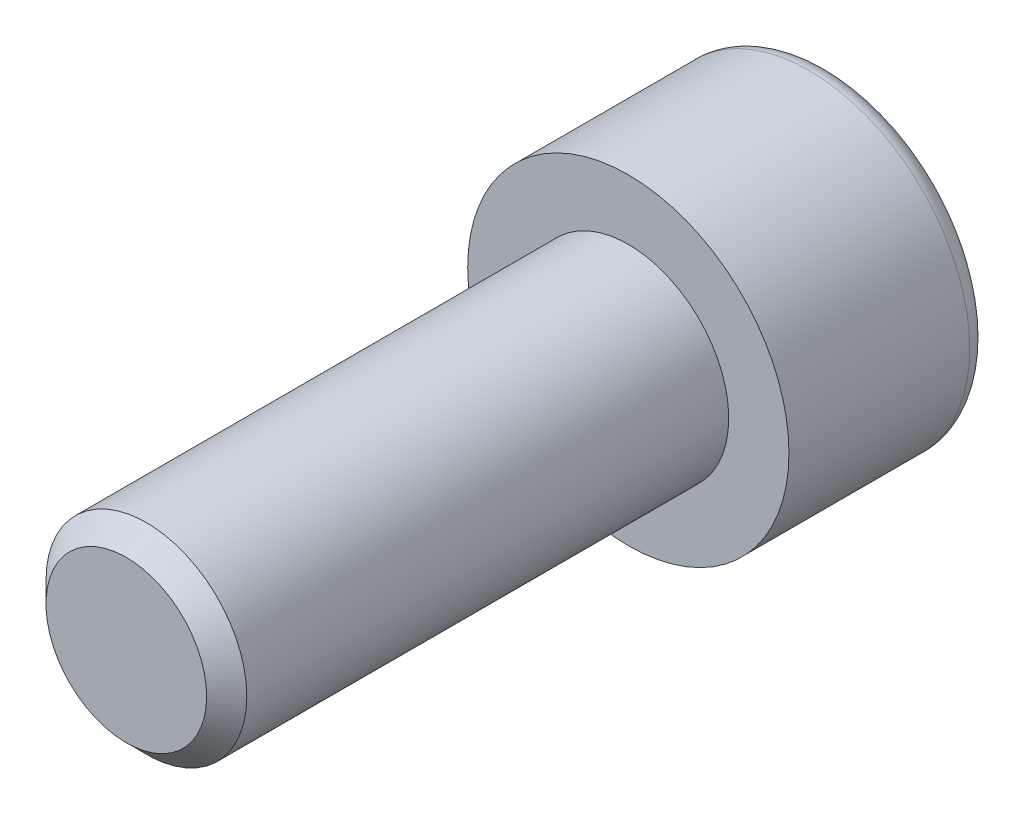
ISO-10303-21;
HEADER;
FILE_DESCRIPTION(('STEP AP214'),'2;1');
FILE_NAME('part.step','',(''),(''),'','','');
FILE_SCHEMA(('AUTOMOTIVE_DESIGN { 1 0 10303 214 1 1 1 1 }'));
ENDSEC;
DATA;
#1=APPLICATION_CONTEXT('core data for automotive mechanical design processes');
#2=APPLICATION_PROTOCOL_DEFINITION('international standard','automotive_design',2000,#1);
#3=PRODUCT_CONTEXT('',#1,'mechanical');
#4=PRODUCT('Part','Part','',(#3));
#5=PRODUCT_RELATED_PRODUCT_CATEGORY('part','',(#4));
#6=PRODUCT_DEFINITION_FORMATION('','',#4);
#7=PRODUCT_DEFINITION_CONTEXT('part definition',#1,'design');
#8=PRODUCT_DEFINITION('design','',#6,#7);
#9=PRODUCT_DEFINITION_SHAPE('','',#8);
#10=(LENGTH_UNIT() NAMED_UNIT(*) SI_UNIT(.MILLI.,.METRE.));
#11=(NAMED_UNIT(*) PLANE_ANGLE_UNIT() SI_UNIT($,.RADIAN.));
#12=(NAMED_UNIT(*) SI_UNIT($,.STERADIAN.) SOLID_ANGLE_UNIT());
#13=UNCERTAINTY_MEASURE_WITH_UNIT(LENGTH_MEASURE(1.E-05),#10,'distance_accuracy_value','');
#14=(GEOMETRIC_REPRESENTATION_CONTEXT(3) GLOBAL_UNCERTAINTY_ASSIGNED_CONTEXT((#13)) GLOBAL_UNIT_ASSIGNED_CONTEXT((#10,
#11,#12)) REPRESENTATION_CONTEXT('',''));
#15=CARTESIAN_POINT('',(0.,0.,0.));
#16=DIRECTION('',(0.,0.,1.));
#17=DIRECTION('',(1.,0.,0.));
#18=AXIS2_PLACEMENT_3D('',#15,#16,#17);
#19=CARTESIAN_POINT('',(0.,0.,-10.));
#20=DIRECTION('',(0.,0.,1.));
#21=DIRECTION('',(1.,0.,0.));
#22=AXIS2_PLACEMENT_3D('',#19,#20,#21);
#23=PLANE('',#22);
#24=CARTESIAN_POINT('',(0.,0.,-10.));
#25=DIRECTION('',(0.,0.,-1.));
#26=DIRECTION('',(-1.,0.,0.));
#27=AXIS2_PLACEMENT_3D('',#24,#25,#26);
#28=CIRCLE('',#27,7.);
#29=CARTESIAN_POINT('',(-7.,0.,-10.));
#30=VERTEX_POINT('',#29);
#31=EDGE_CURVE('E148',#30,#30,#28,.T.);
#32=ORIENTED_EDGE('',*,*,#31,.T.);
#33=EDGE_LOOP('',(#32));
#34=FACE_BOUND('',#33,.T.);
#35=DIRECTION('',(-0.86602540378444,0.499999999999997,0.));
#36=VECTOR('',#35,1.);
#37=CARTESIAN_POINT('',(0.,4.61880215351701,-10.));
#38=LINE('',#37,#36);
#39=CARTESIAN_POINT('',(4.,2.30940107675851,-10.));
#40=VERTEX_POINT('',#39);
#41=CARTESIAN_POINT('',(0.,4.61880215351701,-10.));
#42=VERTEX_POINT('',#41);
#43=EDGE_CURVE('E51',#40,#42,#38,.T.);
#44=ORIENTED_EDGE('',*,*,#43,.T.);
#45=DIRECTION('',(-0.866025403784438,-0.500000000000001,0.));
#46=VECTOR('',#45,1.);
#47=CARTESIAN_POINT('',(0.,4.61880215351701,-10.));
#48=LINE('',#47,#46);
#49=CARTESIAN_POINT('',(-4.,2.30940107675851,-10.));
#50=VERTEX_POINT('',#49);
#51=EDGE_CURVE('E91',#42,#50,#48,.T.);
#52=ORIENTED_EDGE('',*,*,#51,.T.);
#53=DIRECTION('',(0.,-1.,0.));
#54=VECTOR('',#53,1.);
#55=CARTESIAN_POINT('',(-4.,-2.30940107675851,-10.));
#56=LINE('',#55,#54);
#57=CARTESIAN_POINT('',(-4.,-2.30940107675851,-10.));
#58=VERTEX_POINT('',#57);
#59=EDGE_CURVE('E99',#50,#58,#56,.T.);
#60=ORIENTED_EDGE('',*,*,#59,.T.);
#61=DIRECTION('',(0.866025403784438,-0.500000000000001,0.));
#62=VECTOR('',#61,1.);
#63=CARTESIAN_POINT('',(0.,-4.61880215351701,-10.));
#64=LINE('',#63,#62);
#65=CARTESIAN_POINT('',(0.,-4.61880215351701,-10.));
#66=VERTEX_POINT('',#65);
#67=EDGE_CURVE('E117',#58,#66,#64,.T.);
#68=ORIENTED_EDGE('',*,*,#67,.T.);
#69=DIRECTION('',(0.86602540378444,0.499999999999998,0.));
#70=VECTOR('',#69,1.);
#71=CARTESIAN_POINT('',(0.,-4.61880215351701,-10.));
#72=LINE('',#71,#70);
#73=CARTESIAN_POINT('',(4.,-2.30940107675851,-10.));
#74=VERTEX_POINT('',#73);
#75=EDGE_CURVE('E120',#66,#74,#72,.T.);
#76=ORIENTED_EDGE('',*,*,#75,.T.);
#77=DIRECTION('',(0.,1.,0.));
#78=VECTOR('',#77,1.);
#79=CARTESIAN_POINT('',(4.,-2.30940107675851,-10.));
#80=LINE('',#79,#78);
#81=EDGE_CURVE('E110',#74,#40,#80,.T.);
#82=ORIENTED_EDGE('',*,*,#81,.T.);
#83=EDGE_LOOP('',(#44,#52,#60,#68,#76,#82));
#84=FACE_BOUND('',#83,.T.);
#85=ADVANCED_FACE('F37',(#34,#84),#23,.F.);
#86=CARTESIAN_POINT('',(0.,0.,-9.));
#87=DIRECTION('',(0.,0.,-1.));
#88=DIRECTION('',(-1.,0.,0.));
#89=AXIS2_PLACEMENT_3D('',#86,#87,#88);
#90=TOROIDAL_SURFACE('',#89,7.,0.999999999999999);
#91=ORIENTED_EDGE('',*,*,#31,.F.);
#92=EDGE_LOOP('',(#91));
#93=FACE_BOUND('',#92,.T.);
#94=CARTESIAN_POINT('',(0.,0.,-9.));
#95=DIRECTION('',(0.,0.,-1.));
#96=DIRECTION('',(-1.,0.,0.));
#97=AXIS2_PLACEMENT_3D('',#94,#95,#96);
#98=CIRCLE('',#97,8.);
#99=CARTESIAN_POINT('',(-8.,0.,-9.));
#100=VERTEX_POINT('',#99);
#101=EDGE_CURVE('E144',#100,#100,#98,.T.);
#102=ORIENTED_EDGE('',*,*,#101,.T.);
#103=EDGE_LOOP('',(#102));
#104=FACE_BOUND('',#103,.T.);
#105=ADVANCED_FACE('F167',(#93,#104),#90,.T.);
#106=CARTESIAN_POINT('',(0.,0.,0.));
#107=DIRECTION('',(0.,0.,-1.));
#108=DIRECTION('',(-1.,0.,0.));
#109=AXIS2_PLACEMENT_3D('',#106,#107,#108);
#110=CYLINDRICAL_SURFACE('',#109,8.);
#111=ORIENTED_EDGE('',*,*,#101,.F.);
#112=EDGE_LOOP('',(#111));
#113=FACE_BOUND('',#112,.T.);
#114=CARTESIAN_POINT('',(0.,0.,0.));
#115=DIRECTION('',(0.,0.,-1.));
#116=DIRECTION('',(-1.,0.,0.));
#117=AXIS2_PLACEMENT_3D('',#114,#115,#116);
#118=CIRCLE('',#117,8.);
#119=CARTESIAN_POINT('',(-8.,0.,0.));
#120=VERTEX_POINT('',#119);
#121=EDGE_CURVE('E105',#120,#120,#118,.T.);
#122=ORIENTED_EDGE('',*,*,#121,.T.);
#123=EDGE_LOOP('',(#122));
#124=FACE_BOUND('',#123,.T.);
#125=ADVANCED_FACE('F172',(#113,#124),#110,.T.);
#126=CARTESIAN_POINT('',(0.,0.,0.));
#127=DIRECTION('',(0.,0.,-1.));
#128=DIRECTION('',(-1.,0.,0.));
#129=AXIS2_PLACEMENT_3D('',#126,#127,#128);
#130=PLANE('',#129);
#131=CARTESIAN_POINT('',(0.,0.,0.));
#132=DIRECTION('',(0.,0.,1.));
#133=DIRECTION('',(1.,0.,0.));
#134=AXIS2_PLACEMENT_3D('',#131,#132,#133);
#135=CIRCLE('',#134,5.);
#136=CARTESIAN_POINT('',(5.,0.,0.));
#137=VERTEX_POINT('',#136);
#138=EDGE_CURVE('E111',#137,#137,#135,.T.);
#139=ORIENTED_EDGE('',*,*,#138,.F.);
#140=EDGE_LOOP('',(#139));
#141=FACE_BOUND('',#140,.T.);
#142=ORIENTED_EDGE('',*,*,#121,.F.);
#143=EDGE_LOOP('',(#142));
#144=FACE_BOUND('',#143,.T.);
#145=ADVANCED_FACE('F180',(#141,#144),#130,.F.);
#146=CARTESIAN_POINT('',(0.,4.61880215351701,-5.));
#147=DIRECTION('',(-0.499999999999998,-0.86602540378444,0.));
#148=DIRECTION('',(0.86602540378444,-0.499999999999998,0.));
#149=AXIS2_PLACEMENT_3D('',#146,#147,#148);
#150=PLANE('',#149);
#151=ORIENTED_EDGE('',*,*,#43,.F.);
#152=DIRECTION('',(0.,0.,-1.));
#153=VECTOR('',#152,1.);
#154=CARTESIAN_POINT('',(4.,2.30940107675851,-5.));
#155=LINE('',#154,#153);
#156=CARTESIAN_POINT('',(4.,2.30940107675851,-5.));
#157=VERTEX_POINT('',#156);
#158=EDGE_CURVE('E133',#157,#40,#155,.T.);
#159=ORIENTED_EDGE('',*,*,#158,.F.);
#160=DIRECTION('',(-0.86602540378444,0.499999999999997,0.));
#161=VECTOR('',#160,1.);
#162=CARTESIAN_POINT('',(0.,4.61880215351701,-5.));
#163=LINE('',#162,#161);
#164=CARTESIAN_POINT('',(0.,4.61880215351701,-5.));
#165=VERTEX_POINT('',#164);
#166=EDGE_CURVE('E104',#157,#165,#163,.T.);
#167=ORIENTED_EDGE('',*,*,#166,.T.);
#168=DIRECTION('',(0.,0.,-1.));
#169=VECTOR('',#168,1.);
#170=CARTESIAN_POINT('',(0.,4.61880215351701,-5.));
#171=LINE('',#170,#169);
#172=EDGE_CURVE('E93',#165,#42,#171,.T.);
#173=ORIENTED_EDGE('',*,*,#172,.T.);
#174=EDGE_LOOP('',(#151,#159,#167,#173));
#175=FACE_BOUND('',#174,.T.);
#176=ADVANCED_FACE('F102',(#175),#150,.T.);
#177=CARTESIAN_POINT('',(0.,4.61880215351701,-5.));
#178=DIRECTION('',(0.500000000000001,-0.866025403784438,0.));
#179=DIRECTION('',(0.866025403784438,0.500000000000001,0.));
#180=AXIS2_PLACEMENT_3D('',#177,#178,#179);
#181=PLANE('',#180);
#182=ORIENTED_EDGE('',*,*,#51,.F.);
#183=ORIENTED_EDGE('',*,*,#172,.F.);
#184=DIRECTION('',(-0.866025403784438,-0.500000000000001,0.));
#185=VECTOR('',#184,1.);
#186=CARTESIAN_POINT('',(0.,4.61880215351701,-5.));
#187=LINE('',#186,#185);
#188=CARTESIAN_POINT('',(-4.,2.30940107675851,-5.));
#189=VERTEX_POINT('',#188);
#190=EDGE_CURVE('E124',#165,#189,#187,.T.);
#191=ORIENTED_EDGE('',*,*,#190,.T.);
#192=DIRECTION('',(0.,0.,-1.));
#193=VECTOR('',#192,1.);
#194=CARTESIAN_POINT('',(-4.,2.30940107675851,-5.));
#195=LINE('',#194,#193);
#196=EDGE_CURVE('E95',#189,#50,#195,.T.);
#197=ORIENTED_EDGE('',*,*,#196,.T.);
#198=EDGE_LOOP('',(#182,#183,#191,#197));
#199=FACE_BOUND('',#198,.T.);
#200=ADVANCED_FACE('F92',(#199),#181,.T.);
#201=CARTESIAN_POINT('',(-4.,-2.30940107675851,-5.));
#202=DIRECTION('',(1.,0.,0.));
#203=DIRECTION('',(0.,0.,-1.));
#204=AXIS2_PLACEMENT_3D('',#201,#202,#203);
#205=PLANE('',#204);
#206=ORIENTED_EDGE('',*,*,#59,.F.);
#207=ORIENTED_EDGE('',*,*,#196,.F.);
#208=DIRECTION('',(0.,-1.,0.));
#209=VECTOR('',#208,1.);
#210=CARTESIAN_POINT('',(-4.,-2.30940107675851,-5.));
#211=LINE('',#210,#209);
#212=CARTESIAN_POINT('',(-4.,-2.30940107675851,-5.));
#213=VERTEX_POINT('',#212);
#214=EDGE_CURVE('E126',#189,#213,#211,.T.);
#215=ORIENTED_EDGE('',*,*,#214,.T.);
#216=DIRECTION('',(0.,0.,-1.));
#217=VECTOR('',#216,1.);
#218=CARTESIAN_POINT('',(-4.,-2.30940107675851,-5.));
#219=LINE('',#218,#217);
#220=EDGE_CURVE('E139',#213,#58,#219,.T.);
#221=ORIENTED_EDGE('',*,*,#220,.T.);
#222=EDGE_LOOP('',(#206,#207,#215,#221));
#223=FACE_BOUND('',#222,.T.);
#224=ADVANCED_FACE('F195',(#223),#205,.T.);
#225=CARTESIAN_POINT('',(0.,-4.61880215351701,-5.));
#226=DIRECTION('',(0.500000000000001,0.866025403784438,0.));
#227=DIRECTION('',(-0.866025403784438,0.500000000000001,0.));
#228=AXIS2_PLACEMENT_3D('',#225,#226,#227);
#229=PLANE('',#228);
#230=ORIENTED_EDGE('',*,*,#67,.F.);
#231=ORIENTED_EDGE('',*,*,#220,.F.);
#232=DIRECTION('',(0.866025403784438,-0.500000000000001,0.));
#233=VECTOR('',#232,1.);
#234=CARTESIAN_POINT('',(0.,-4.61880215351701,-5.));
#235=LINE('',#234,#233);
#236=CARTESIAN_POINT('',(0.,-4.61880215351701,-5.));
#237=VERTEX_POINT('',#236);
#238=EDGE_CURVE('E128',#213,#237,#235,.T.);
#239=ORIENTED_EDGE('',*,*,#238,.T.);
#240=DIRECTION('',(0.,0.,-1.));
#241=VECTOR('',#240,1.);
#242=CARTESIAN_POINT('',(0.,-4.61880215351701,-5.));
#243=LINE('',#242,#241);
#244=EDGE_CURVE('E137',#237,#66,#243,.T.);
#245=ORIENTED_EDGE('',*,*,#244,.T.);
#246=EDGE_LOOP('',(#230,#231,#239,#245));
#247=FACE_BOUND('',#246,.T.);
#248=ADVANCED_FACE('F198',(#247),#229,.T.);
#249=CARTESIAN_POINT('',(0.,-4.61880215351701,-5.));
#250=DIRECTION('',(-0.499999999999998,0.86602540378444,0.));
#251=DIRECTION('',(-0.86602540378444,-0.499999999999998,0.));
#252=AXIS2_PLACEMENT_3D('',#249,#250,#251);
#253=PLANE('',#252);
#254=ORIENTED_EDGE('',*,*,#75,.F.);
#255=ORIENTED_EDGE('',*,*,#244,.F.);
#256=DIRECTION('',(0.86602540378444,0.499999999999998,0.));
#257=VECTOR('',#256,1.);
#258=CARTESIAN_POINT('',(0.,-4.61880215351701,-5.));
#259=LINE('',#258,#257);
#260=CARTESIAN_POINT('',(4.,-2.30940107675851,-5.));
#261=VERTEX_POINT('',#260);
#262=EDGE_CURVE('E130',#237,#261,#259,.T.);
#263=ORIENTED_EDGE('',*,*,#262,.T.);
#264=DIRECTION('',(0.,0.,-1.));
#265=VECTOR('',#264,1.);
#266=CARTESIAN_POINT('',(4.,-2.30940107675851,-5.));
#267=LINE('',#266,#265);
#268=EDGE_CURVE('E135',#261,#74,#267,.T.);
#269=ORIENTED_EDGE('',*,*,#268,.T.);
#270=EDGE_LOOP('',(#254,#255,#263,#269));
#271=FACE_BOUND('',#270,.T.);
#272=ADVANCED_FACE('F202',(#271),#253,.T.);
#273=CARTESIAN_POINT('',(4.,-2.30940107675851,-5.));
#274=DIRECTION('',(-1.,0.,0.));
#275=DIRECTION('',(0.,-1.,0.));
#276=AXIS2_PLACEMENT_3D('',#273,#274,#275);
#277=PLANE('',#276);
#278=ORIENTED_EDGE('',*,*,#81,.F.);
#279=ORIENTED_EDGE('',*,*,#268,.F.);
#280=DIRECTION('',(0.,1.,0.));
#281=VECTOR('',#280,1.);
#282=CARTESIAN_POINT('',(4.,-2.30940107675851,-5.));
#283=LINE('',#282,#281);
#284=EDGE_CURVE('E58',#261,#157,#283,.T.);
#285=ORIENTED_EDGE('',*,*,#284,.T.);
#286=ORIENTED_EDGE('',*,*,#158,.T.);
#287=EDGE_LOOP('',(#278,#279,#285,#286));
#288=FACE_BOUND('',#287,.T.);
#289=ADVANCED_FACE('F206',(#288),#277,.T.);
#290=CARTESIAN_POINT('',(4.,2.30940107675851,-5.));
#291=DIRECTION('',(0.,0.,1.));
#292=DIRECTION('',(1.,0.,0.));
#293=AXIS2_PLACEMENT_3D('',#290,#291,#292);
#294=PLANE('',#293);
#295=ORIENTED_EDGE('',*,*,#166,.F.);
#296=ORIENTED_EDGE('',*,*,#284,.F.);
#297=ORIENTED_EDGE('',*,*,#262,.F.);
#298=ORIENTED_EDGE('',*,*,#238,.F.);
#299=ORIENTED_EDGE('',*,*,#214,.F.);
#300=ORIENTED_EDGE('',*,*,#190,.F.);
#301=EDGE_LOOP('',(#295,#296,#297,#298,#299,#300));
#302=FACE_BOUND('',#301,.T.);
#303=ADVANCED_FACE('F210',(#302),#294,.F.);
#304=CARTESIAN_POINT('',(0.,0.,25.));
#305=DIRECTION('',(0.,0.,1.));
#306=DIRECTION('',(1.,0.,0.));
#307=AXIS2_PLACEMENT_3D('',#304,#305,#306);
#308=PLANE('',#307);
#309=CARTESIAN_POINT('',(0.,0.,25.));
#310=DIRECTION('',(0.,0.,1.));
#311=DIRECTION('',(1.,0.,0.));
#312=AXIS2_PLACEMENT_3D('',#309,#310,#311);
#313=CIRCLE('',#312,4.);
#314=CARTESIAN_POINT('',(4.00000000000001,0.,25.));
#315=VERTEX_POINT('',#314);
#316=EDGE_CURVE('E44',#315,#315,#313,.T.);
#317=ORIENTED_EDGE('',*,*,#316,.T.);
#318=EDGE_LOOP('',(#317));
#319=FACE_BOUND('',#318,.T.);
#320=ADVANCED_FACE('F153',(#319),#308,.T.);
#321=CARTESIAN_POINT('',(0.,0.,0.));
#322=DIRECTION('',(0.,0.,1.));
#323=DIRECTION('',(1.,0.,0.));
#324=AXIS2_PLACEMENT_3D('',#321,#322,#323);
#325=CYLINDRICAL_SURFACE('',#324,5.);
#326=CARTESIAN_POINT('',(0.,0.,24.));
#327=DIRECTION('',(0.,0.,1.));
#328=DIRECTION('',(1.,0.,0.));
#329=AXIS2_PLACEMENT_3D('',#326,#327,#328);
#330=CIRCLE('',#329,5.);
#331=CARTESIAN_POINT('',(5.,0.,24.));
#332=VERTEX_POINT('',#331);
#333=EDGE_CURVE('E11',#332,#332,#330,.F.);
#334=ORIENTED_EDGE('',*,*,#333,.T.);
#335=EDGE_LOOP('',(#334));
#336=FACE_BOUND('',#335,.T.);
#337=ORIENTED_EDGE('',*,*,#138,.T.);
#338=EDGE_LOOP('',(#337));
#339=FACE_BOUND('',#338,.T.);
#340=ADVANCED_FACE('F157',(#336,#339),#325,.T.);
#341=CARTESIAN_POINT('',(0.,0.,25.));
#342=DIRECTION('',(0.,0.,-1.));
#343=DIRECTION('',(-1.,0.,0.));
#344=AXIS2_PLACEMENT_3D('',#341,#342,#343);
#345=CONICAL_SURFACE('',#344,4.,0.785398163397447);
#346=ORIENTED_EDGE('',*,*,#333,.F.);
#347=EDGE_LOOP('',(#346));
#348=FACE_BOUND('',#347,.T.);
#349=ORIENTED_EDGE('',*,*,#316,.F.);
#350=EDGE_LOOP('',(#349));
#351=FACE_BOUND('',#350,.T.);
#352=ADVANCED_FACE('F155',(#348,#351),#345,.T.);
#353=CLOSED_SHELL('',(#85,#105,#125,#145,#176,#200,#224,#248,#272,#289,#303,#320,#340,#352));
#354=MANIFOLD_SOLID_BREP('B2',#353);
#355=ADVANCED_BREP_SHAPE_REPRESENTATION('',(#18,#354),#14);
#356=SHAPE_DEFINITION_REPRESENTATION(#9,#355);
ENDSEC;
END-ISO-10303-21;
